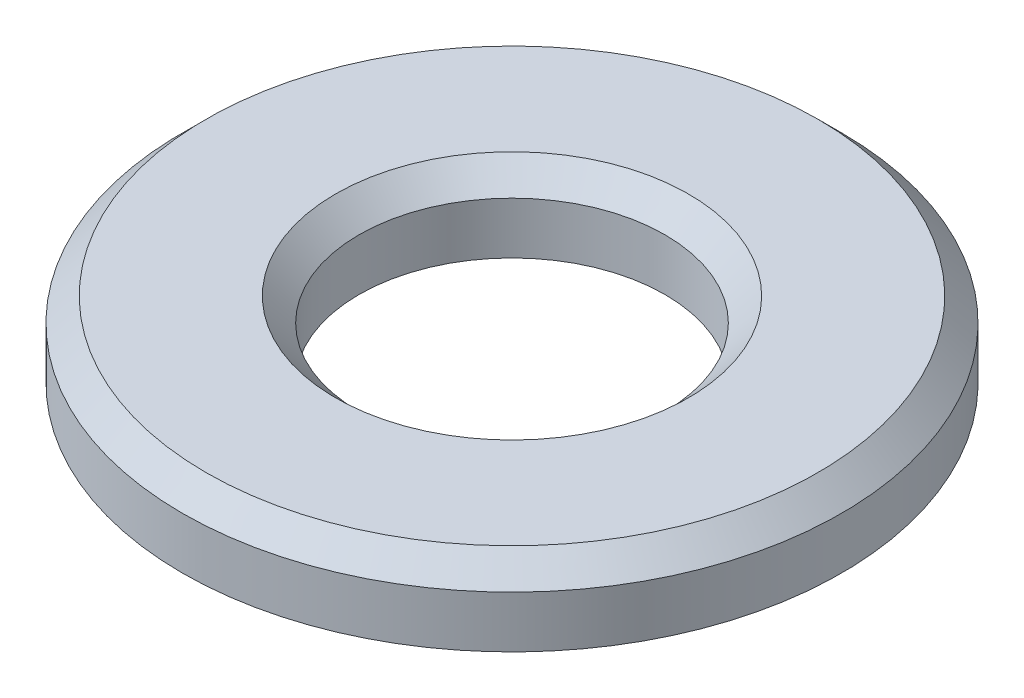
ISO-10303-21;
HEADER;
FILE_DESCRIPTION(('STEP AP214'),'2;1');
FILE_NAME('part.step','',(''),(''),'','','');
FILE_SCHEMA(('AUTOMOTIVE_DESIGN { 1 0 10303 214 1 1 1 1 }'));
ENDSEC;
DATA;
#1=APPLICATION_CONTEXT('core data for automotive mechanical design processes');
#2=APPLICATION_PROTOCOL_DEFINITION('international standard','automotive_design',2000,#1);
#3=PRODUCT_CONTEXT('',#1,'mechanical');
#4=PRODUCT('Part','Part','',(#3));
#5=PRODUCT_RELATED_PRODUCT_CATEGORY('part','',(#4));
#6=PRODUCT_DEFINITION_FORMATION('','',#4);
#7=PRODUCT_DEFINITION_CONTEXT('part definition',#1,'design');
#8=PRODUCT_DEFINITION('design','',#6,#7);
#9=PRODUCT_DEFINITION_SHAPE('','',#8);
#10=(LENGTH_UNIT() NAMED_UNIT(*) SI_UNIT(.MILLI.,.METRE.));
#11=(NAMED_UNIT(*) PLANE_ANGLE_UNIT() SI_UNIT($,.RADIAN.));
#12=(NAMED_UNIT(*) SI_UNIT($,.STERADIAN.) SOLID_ANGLE_UNIT());
#13=UNCERTAINTY_MEASURE_WITH_UNIT(LENGTH_MEASURE(1.E-05),#10,'distance_accuracy_value','');
#14=(GEOMETRIC_REPRESENTATION_CONTEXT(3) GLOBAL_UNCERTAINTY_ASSIGNED_CONTEXT((#13)) GLOBAL_UNIT_ASSIGNED_CONTEXT((#10,
#11,#12)) REPRESENTATION_CONTEXT('',''));
#15=CARTESIAN_POINT('',(0.,0.,0.));
#16=DIRECTION('',(0.,0.,1.));
#17=DIRECTION('',(1.,0.,0.));
#18=AXIS2_PLACEMENT_3D('',#15,#16,#17);
#19=CARTESIAN_POINT('',(0.,1.6,0.));
#20=DIRECTION('',(0.,1.,0.));
#21=DIRECTION('',(0.,0.,1.));
#22=AXIS2_PLACEMENT_3D('',#19,#20,#21);
#23=PLANE('',#22);
#24=CARTESIAN_POINT('',(0.,1.59999999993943,0.));
#25=DIRECTION('',(0.,1.,0.));
#26=DIRECTION('',(-1.,0.,0.));
#27=AXIS2_PLACEMENT_3D('',#24,#25,#26);
#28=CIRCLE('',#27,3.75000000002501);
#29=CARTESIAN_POINT('',(-3.75000000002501,1.59999999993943,0.));
#30=VERTEX_POINT('',#29);
#31=EDGE_CURVE('E31',#30,#30,#28,.F.);
#32=ORIENTED_EDGE('',*,*,#31,.T.);
#33=EDGE_LOOP('',(#32));
#34=FACE_BOUND('',#33,.T.);
#35=CARTESIAN_POINT('',(0.,1.60000000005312,0.));
#36=DIRECTION('',(0.,-1.,0.));
#37=DIRECTION('',(0.,0.,-1.));
#38=AXIS2_PLACEMENT_3D('',#35,#36,#37);
#39=CIRCLE('',#38,6.50000000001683);
#40=CARTESIAN_POINT('',(0.,1.60000000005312,-6.50000000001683));
#41=VERTEX_POINT('',#40);
#42=EDGE_CURVE('E17',#41,#41,#39,.T.);
#43=ORIENTED_EDGE('',*,*,#42,.F.);
#44=EDGE_LOOP('',(#43));
#45=FACE_BOUND('',#44,.T.);
#46=ADVANCED_FACE('F14',(#34,#45),#23,.T.);
#47=CARTESIAN_POINT('',(0.,1.10000000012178,0.));
#48=DIRECTION('',(0.,-1.,0.));
#49=DIRECTION('',(0.,0.,-1.));
#50=AXIS2_PLACEMENT_3D('',#47,#48,#49);
#51=CONICAL_SURFACE('',#50,6.99999999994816,0.785398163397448);
#52=CARTESIAN_POINT('',(0.,1.1,0.));
#53=DIRECTION('',(0.,1.,0.));
#54=DIRECTION('',(0.,0.,1.));
#55=AXIS2_PLACEMENT_3D('',#52,#53,#54);
#56=CIRCLE('',#55,7.);
#57=CARTESIAN_POINT('',(0.,1.1,7.));
#58=VERTEX_POINT('',#57);
#59=EDGE_CURVE('E29',#58,#58,#56,.F.);
#60=ORIENTED_EDGE('',*,*,#59,.F.);
#61=EDGE_LOOP('',(#60));
#62=FACE_BOUND('',#61,.T.);
#63=ORIENTED_EDGE('',*,*,#42,.T.);
#64=EDGE_LOOP('',(#63));
#65=FACE_BOUND('',#64,.T.);
#66=ADVANCED_FACE('F39',(#62,#65),#51,.T.);
#67=CARTESIAN_POINT('',(0.,1.59999999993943,0.));
#68=DIRECTION('',(0.,1.,0.));
#69=DIRECTION('',(-1.,0.,0.));
#70=AXIS2_PLACEMENT_3D('',#67,#68,#69);
#71=CONICAL_SURFACE('',#70,3.75000000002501,0.785398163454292);
#72=CARTESIAN_POINT('',(0.,1.1,0.));
#73=DIRECTION('',(0.,1.,0.));
#74=DIRECTION('',(0.,0.,1.));
#75=AXIS2_PLACEMENT_3D('',#72,#73,#74);
#76=CIRCLE('',#75,3.25);
#77=CARTESIAN_POINT('',(0.,1.1,3.25));
#78=VERTEX_POINT('',#77);
#79=EDGE_CURVE('E26',#78,#78,#76,.F.);
#80=ORIENTED_EDGE('',*,*,#79,.T.);
#81=EDGE_LOOP('',(#80));
#82=FACE_BOUND('',#81,.T.);
#83=ORIENTED_EDGE('',*,*,#31,.F.);
#84=EDGE_LOOP('',(#83));
#85=FACE_BOUND('',#84,.T.);
#86=ADVANCED_FACE('F47',(#82,#85),#71,.F.);
#87=CARTESIAN_POINT('',(0.,0.,0.));
#88=DIRECTION('',(0.,1.,0.));
#89=DIRECTION('',(0.,0.,1.));
#90=AXIS2_PLACEMENT_3D('',#87,#88,#89);
#91=CYLINDRICAL_SURFACE('',#90,7.);
#92=CARTESIAN_POINT('',(0.,0.,0.));
#93=DIRECTION('',(0.,1.,0.));
#94=DIRECTION('',(0.,0.,1.));
#95=AXIS2_PLACEMENT_3D('',#92,#93,#94);
#96=CIRCLE('',#95,7.);
#97=CARTESIAN_POINT('',(0.,0.,7.));
#98=VERTEX_POINT('',#97);
#99=EDGE_CURVE('E21',#98,#98,#96,.T.);
#100=ORIENTED_EDGE('',*,*,#99,.T.);
#101=EDGE_LOOP('',(#100));
#102=FACE_BOUND('',#101,.T.);
#103=ORIENTED_EDGE('',*,*,#59,.T.);
#104=EDGE_LOOP('',(#103));
#105=FACE_BOUND('',#104,.T.);
#106=ADVANCED_FACE('F58',(#102,#105),#91,.T.);
#107=CARTESIAN_POINT('',(0.,0.,0.));
#108=DIRECTION('',(0.,1.,0.));
#109=DIRECTION('',(0.,0.,1.));
#110=AXIS2_PLACEMENT_3D('',#107,#108,#109);
#111=CYLINDRICAL_SURFACE('',#110,3.25);
#112=CARTESIAN_POINT('',(0.,0.,0.));
#113=DIRECTION('',(0.,1.,0.));
#114=DIRECTION('',(0.,0.,1.));
#115=AXIS2_PLACEMENT_3D('',#112,#113,#114);
#116=CIRCLE('',#115,3.25);
#117=CARTESIAN_POINT('',(0.,0.,3.25));
#118=VERTEX_POINT('',#117);
#119=EDGE_CURVE('E10',#118,#118,#116,.F.);
#120=ORIENTED_EDGE('',*,*,#119,.T.);
#121=EDGE_LOOP('',(#120));
#122=FACE_BOUND('',#121,.T.);
#123=ORIENTED_EDGE('',*,*,#79,.F.);
#124=EDGE_LOOP('',(#123));
#125=FACE_BOUND('',#124,.T.);
#126=ADVANCED_FACE('F51',(#122,#125),#111,.F.);
#127=CARTESIAN_POINT('',(0.,0.,0.));
#128=DIRECTION('',(0.,1.,0.));
#129=DIRECTION('',(0.,0.,1.));
#130=AXIS2_PLACEMENT_3D('',#127,#128,#129);
#131=PLANE('',#130);
#132=ORIENTED_EDGE('',*,*,#119,.F.);
#133=EDGE_LOOP('',(#132));
#134=FACE_BOUND('',#133,.T.);
#135=ORIENTED_EDGE('',*,*,#99,.F.);
#136=EDGE_LOOP('',(#135));
#137=FACE_BOUND('',#136,.T.);
#138=ADVANCED_FACE('F49',(#134,#137),#131,.F.);
#139=CLOSED_SHELL('',(#46,#66,#86,#106,#126,#138));
#140=MANIFOLD_SOLID_BREP('B1',#139);
#141=ADVANCED_BREP_SHAPE_REPRESENTATION('',(#18,#140),#14);
#142=SHAPE_DEFINITION_REPRESENTATION(#9,#141);
ENDSEC;
END-ISO-10303-21;
